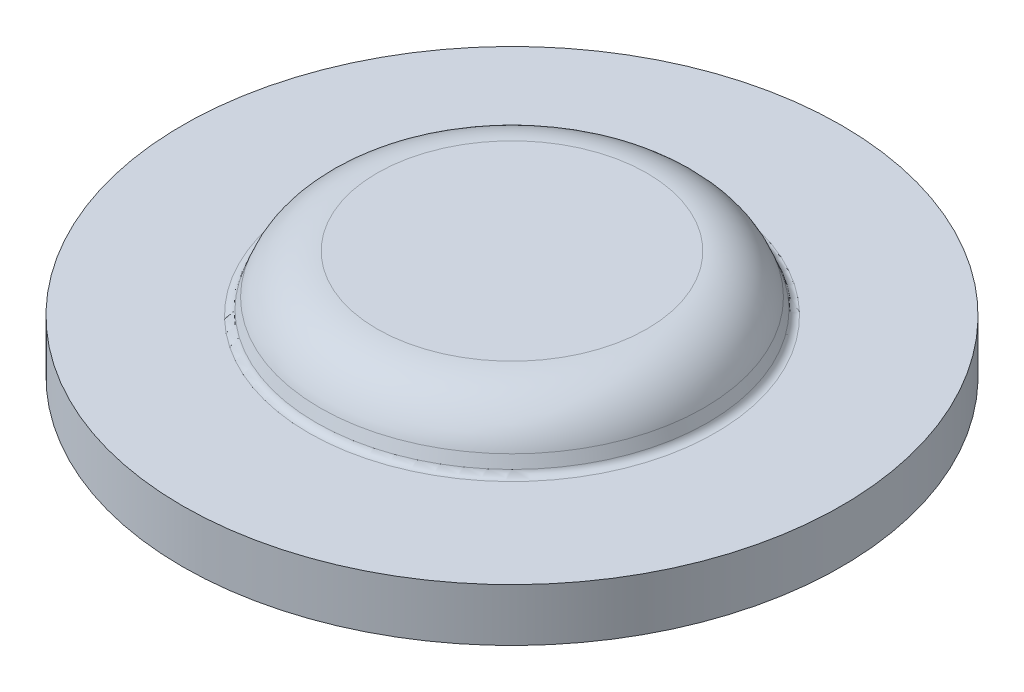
ISO-10303-21;
HEADER;
FILE_DESCRIPTION(('STEP AP214'),'2;1');
FILE_NAME('part.step','',(''),(''),'','','');
FILE_SCHEMA(('AUTOMOTIVE_DESIGN { 1 0 10303 214 1 1 1 1 }'));
ENDSEC;
DATA;
#1=APPLICATION_CONTEXT('core data for automotive mechanical design processes');
#2=APPLICATION_PROTOCOL_DEFINITION('international standard','automotive_design',2000,#1);
#3=PRODUCT_CONTEXT('',#1,'mechanical');
#4=PRODUCT('Part','Part','',(#3));
#5=PRODUCT_RELATED_PRODUCT_CATEGORY('part','',(#4));
#6=PRODUCT_DEFINITION_FORMATION('','',#4);
#7=PRODUCT_DEFINITION_CONTEXT('part definition',#1,'design');
#8=PRODUCT_DEFINITION('design','',#6,#7);
#9=PRODUCT_DEFINITION_SHAPE('','',#8);
#10=(LENGTH_UNIT() NAMED_UNIT(*) SI_UNIT(.MILLI.,.METRE.));
#11=(NAMED_UNIT(*) PLANE_ANGLE_UNIT() SI_UNIT($,.RADIAN.));
#12=(NAMED_UNIT(*) SI_UNIT($,.STERADIAN.) SOLID_ANGLE_UNIT());
#13=UNCERTAINTY_MEASURE_WITH_UNIT(LENGTH_MEASURE(1.E-05),#10,'distance_accuracy_value','');
#14=(GEOMETRIC_REPRESENTATION_CONTEXT(3) GLOBAL_UNCERTAINTY_ASSIGNED_CONTEXT((#13)) GLOBAL_UNIT_ASSIGNED_CONTEXT((#10,
#11,#12)) REPRESENTATION_CONTEXT('',''));
#15=CARTESIAN_POINT('',(0.,0.,0.));
#16=DIRECTION('',(0.,0.,1.));
#17=DIRECTION('',(1.,0.,0.));
#18=AXIS2_PLACEMENT_3D('',#15,#16,#17);
#19=CARTESIAN_POINT('',(0.,0.,0.));
#20=DIRECTION('',(0.,-1.,0.));
#21=DIRECTION('',(0.,0.,-1.));
#22=AXIS2_PLACEMENT_3D('',#19,#20,#21);
#23=PLANE('',#22);
#24=CARTESIAN_POINT('',(0.,0.,0.));
#25=DIRECTION('',(0.,1.,0.));
#26=DIRECTION('',(0.,0.,1.));
#27=AXIS2_PLACEMENT_3D('',#24,#25,#26);
#28=CIRCLE('',#27,6.5024);
#29=CARTESIAN_POINT('',(0.,0.,6.5024));
#30=VERTEX_POINT('',#29);
#31=EDGE_CURVE('E20',#30,#30,#28,.F.);
#32=ORIENTED_EDGE('',*,*,#31,.F.);
#33=EDGE_LOOP('',(#32));
#34=FACE_BOUND('',#33,.T.);
#35=ADVANCED_FACE('F16',(#34),#23,.F.);
#36=CARTESIAN_POINT('',(0.,-2.92099999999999,0.));
#37=DIRECTION('',(0.,1.,0.));
#38=DIRECTION('',(0.,0.,1.));
#39=AXIS2_PLACEMENT_3D('',#36,#37,#38);
#40=TOROIDAL_SURFACE('',#39,6.5024,2.92099999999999);
#41=CARTESIAN_POINT('',(0.,-1.92195916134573,0.));
#42=DIRECTION('',(0.,-1.,0.));
#43=DIRECTION('',(1.,0.,0.));
#44=AXIS2_PLACEMENT_3D('',#41,#42,#43);
#45=CIRCLE('',#44,9.24724214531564);
#46=CARTESIAN_POINT('',(9.24724214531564,-1.92195916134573,0.));
#47=VERTEX_POINT('',#46);
#48=EDGE_CURVE('E32',#47,#47,#45,.T.);
#49=ORIENTED_EDGE('',*,*,#48,.F.);
#50=EDGE_LOOP('',(#49));
#51=FACE_BOUND('',#50,.T.);
#52=ORIENTED_EDGE('',*,*,#31,.T.);
#53=EDGE_LOOP('',(#52));
#54=FACE_BOUND('',#53,.T.);
#55=ADVANCED_FACE('F53',(#51,#54),#40,.T.);
#56=CARTESIAN_POINT('',(0.,-2.54,0.));
#57=DIRECTION('',(0.,1.,0.));
#58=DIRECTION('',(0.,0.,1.));
#59=AXIS2_PLACEMENT_3D('',#56,#57,#58);
#60=PLANE('',#59);
#61=CARTESIAN_POINT('',(0.,-2.54,0.));
#62=DIRECTION('',(0.,1.,0.));
#63=DIRECTION('',(0.,0.,1.));
#64=AXIS2_PLACEMENT_3D('',#61,#62,#63);
#65=CIRCLE('',#64,6.5024);
#66=CARTESIAN_POINT('',(0.,-2.54,6.5024));
#67=VERTEX_POINT('',#66);
#68=EDGE_CURVE('E41',#67,#67,#65,.F.);
#69=ORIENTED_EDGE('',*,*,#68,.T.);
#70=EDGE_LOOP('',(#69));
#71=FACE_BOUND('',#70,.T.);
#72=ADVANCED_FACE('F60',(#71),#60,.F.);
#73=CARTESIAN_POINT('',(0.,-2.44170967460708,0.));
#74=DIRECTION('',(0.,-1.,0.));
#75=DIRECTION('',(1.,0.,0.));
#76=AXIS2_PLACEMENT_3D('',#73,#74,#75);
#77=CONICAL_SURFACE('',#76,9.43641586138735,0.349065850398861);
#78=CARTESIAN_POINT('',(0.,-2.44170967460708,0.));
#79=DIRECTION('',(0.,1.,0.));
#80=DIRECTION('',(0.,0.,-1.));
#81=AXIS2_PLACEMENT_3D('',#78,#79,#80);
#82=CIRCLE('',#81,9.43641586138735);
#83=CARTESIAN_POINT('',(0.,-2.44170967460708,-9.43641586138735));
#84=VERTEX_POINT('',#83);
#85=EDGE_CURVE('E43',#84,#84,#82,.T.);
#86=ORIENTED_EDGE('',*,*,#85,.T.);
#87=EDGE_LOOP('',(#86));
#88=FACE_BOUND('',#87,.T.);
#89=ORIENTED_EDGE('',*,*,#48,.T.);
#90=EDGE_LOOP('',(#89));
#91=FACE_BOUND('',#90,.T.);
#92=ADVANCED_FACE('F85',(#88,#91),#77,.T.);
#93=CARTESIAN_POINT('',(0.,-2.921,0.));
#94=DIRECTION('',(0.,1.,0.));
#95=DIRECTION('',(0.,0.,1.));
#96=AXIS2_PLACEMENT_3D('',#93,#94,#95);
#97=TOROIDAL_SURFACE('',#96,6.5024,0.381000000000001);
#98=ORIENTED_EDGE('',*,*,#68,.F.);
#99=EDGE_LOOP('',(#98));
#100=FACE_BOUND('',#99,.T.);
#101=CARTESIAN_POINT('',(0.,-2.79069032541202,0.));
#102=DIRECTION('',(0.,-1.,0.));
#103=DIRECTION('',(0.,0.,-1.));
#104=AXIS2_PLACEMENT_3D('',#101,#102,#103);
#105=CIRCLE('',#104,6.86042288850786);
#106=CARTESIAN_POINT('',(0.,-2.79069032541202,-6.86042288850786));
#107=VERTEX_POINT('',#106);
#108=EDGE_CURVE('E40',#107,#107,#105,.T.);
#109=ORIENTED_EDGE('',*,*,#108,.T.);
#110=EDGE_LOOP('',(#109));
#111=FACE_BOUND('',#110,.T.);
#112=ADVANCED_FACE('F87',(#100,#111),#97,.F.);
#113=CARTESIAN_POINT('',(0.,-2.3114,0.));
#114=DIRECTION('',(0.,1.,0.));
#115=DIRECTION('',(0.,0.,1.));
#116=AXIS2_PLACEMENT_3D('',#113,#114,#115);
#117=TOROIDAL_SURFACE('',#116,9.79443874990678,0.380999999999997);
#118=CARTESIAN_POINT('',(0.,-2.6924,0.));
#119=DIRECTION('',(0.,1.,0.));
#120=DIRECTION('',(0.,0.,1.));
#121=AXIS2_PLACEMENT_3D('',#118,#119,#120);
#122=CIRCLE('',#121,9.79443874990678);
#123=CARTESIAN_POINT('',(0.,-2.6924,9.79443874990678));
#124=VERTEX_POINT('',#123);
#125=EDGE_CURVE('E38',#124,#124,#122,.T.);
#126=ORIENTED_EDGE('',*,*,#125,.T.);
#127=EDGE_LOOP('',(#126));
#128=FACE_BOUND('',#127,.T.);
#129=ORIENTED_EDGE('',*,*,#85,.F.);
#130=EDGE_LOOP('',(#129));
#131=FACE_BOUND('',#130,.T.);
#132=ADVANCED_FACE('F83',(#128,#131),#117,.F.);
#133=CARTESIAN_POINT('',(0.,-3.31044083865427,0.));
#134=DIRECTION('',(0.,-1.,0.));
#135=DIRECTION('',(1.,0.,0.));
#136=AXIS2_PLACEMENT_3D('',#133,#134,#135);
#137=CONICAL_SURFACE('',#136,7.04959660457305,0.349065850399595);
#138=CARTESIAN_POINT('',(0.,-3.31044083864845,0.));
#139=DIRECTION('',(0.,1.,0.));
#140=DIRECTION('',(0.,0.,-1.));
#141=AXIS2_PLACEMENT_3D('',#138,#139,#140);
#142=CIRCLE('',#141,7.04959660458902);
#143=CARTESIAN_POINT('',(0.,-3.31044083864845,-7.04959660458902));
#144=VERTEX_POINT('',#143);
#145=EDGE_CURVE('E37',#144,#144,#142,.T.);
#146=ORIENTED_EDGE('',*,*,#145,.F.);
#147=EDGE_LOOP('',(#146));
#148=FACE_BOUND('',#147,.T.);
#149=ORIENTED_EDGE('',*,*,#108,.F.);
#150=EDGE_LOOP('',(#149));
#151=FACE_BOUND('',#150,.T.);
#152=ADVANCED_FACE('F79',(#148,#151),#137,.F.);
#153=CARTESIAN_POINT('',(9.79443874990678,-2.6924,0.));
#154=DIRECTION('',(0.,-1.,0.));
#155=DIRECTION('',(0.,0.,-1.));
#156=AXIS2_PLACEMENT_3D('',#153,#154,#155);
#157=PLANE('',#156);
#158=CARTESIAN_POINT('',(0.,-2.6924,0.));
#159=DIRECTION('',(0.,1.,0.));
#160=DIRECTION('',(0.,0.,1.));
#161=AXIS2_PLACEMENT_3D('',#158,#159,#160);
#162=CIRCLE('',#161,15.875);
#163=CARTESIAN_POINT('',(0.,-2.6924,15.875));
#164=VERTEX_POINT('',#163);
#165=EDGE_CURVE('E29',#164,#164,#162,.F.);
#166=ORIENTED_EDGE('',*,*,#165,.F.);
#167=EDGE_LOOP('',(#166));
#168=FACE_BOUND('',#167,.T.);
#169=ORIENTED_EDGE('',*,*,#125,.F.);
#170=EDGE_LOOP('',(#169));
#171=FACE_BOUND('',#170,.T.);
#172=ADVANCED_FACE('F76',(#168,#171),#157,.F.);
#173=CARTESIAN_POINT('',(0.,-2.3114,0.));
#174=DIRECTION('',(0.,1.,0.));
#175=DIRECTION('',(0.,0.,1.));
#176=AXIS2_PLACEMENT_3D('',#173,#174,#175);
#177=TOROIDAL_SURFACE('',#176,9.79443874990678,2.921);
#178=ORIENTED_EDGE('',*,*,#145,.T.);
#179=EDGE_LOOP('',(#178));
#180=FACE_BOUND('',#179,.T.);
#181=CARTESIAN_POINT('',(0.,-5.2324,0.));
#182=DIRECTION('',(0.,1.,0.));
#183=DIRECTION('',(0.,0.,1.));
#184=AXIS2_PLACEMENT_3D('',#181,#182,#183);
#185=CIRCLE('',#184,9.79443874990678);
#186=CARTESIAN_POINT('',(0.,-5.2324,9.79443874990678));
#187=VERTEX_POINT('',#186);
#188=EDGE_CURVE('E24',#187,#187,#185,.F.);
#189=ORIENTED_EDGE('',*,*,#188,.T.);
#190=EDGE_LOOP('',(#189));
#191=FACE_BOUND('',#190,.T.);
#192=ADVANCED_FACE('F18',(#180,#191),#177,.T.);
#193=CARTESIAN_POINT('',(0.,-5.2336539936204,0.));
#194=DIRECTION('',(0.,1.,0.));
#195=DIRECTION('',(0.,0.,1.));
#196=AXIS2_PLACEMENT_3D('',#193,#194,#195);
#197=CYLINDRICAL_SURFACE('',#196,15.875);
#198=ORIENTED_EDGE('',*,*,#165,.T.);
#199=EDGE_LOOP('',(#198));
#200=FACE_BOUND('',#199,.T.);
#201=CARTESIAN_POINT('',(0.,-5.2324,0.));
#202=DIRECTION('',(0.,1.,0.));
#203=DIRECTION('',(0.,0.,1.));
#204=AXIS2_PLACEMENT_3D('',#201,#202,#203);
#205=CIRCLE('',#204,15.875);
#206=CARTESIAN_POINT('',(0.,-5.2324,15.875));
#207=VERTEX_POINT('',#206);
#208=EDGE_CURVE('E10',#207,#207,#205,.T.);
#209=ORIENTED_EDGE('',*,*,#208,.T.);
#210=EDGE_LOOP('',(#209));
#211=FACE_BOUND('',#210,.T.);
#212=ADVANCED_FACE('F66',(#200,#211),#197,.T.);
#213=CARTESIAN_POINT('',(9.79443874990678,-5.2324,0.));
#214=DIRECTION('',(0.,1.,0.));
#215=DIRECTION('',(0.,0.,1.));
#216=AXIS2_PLACEMENT_3D('',#213,#214,#215);
#217=PLANE('',#216);
#218=ORIENTED_EDGE('',*,*,#208,.F.);
#219=EDGE_LOOP('',(#218));
#220=FACE_BOUND('',#219,.T.);
#221=ORIENTED_EDGE('',*,*,#188,.F.);
#222=EDGE_LOOP('',(#221));
#223=FACE_BOUND('',#222,.T.);
#224=ADVANCED_FACE('F64',(#220,#223),#217,.F.);
#225=CLOSED_SHELL('',(#35,#55,#72,#92,#112,#132,#152,#172,#192,#212,#224));
#226=MANIFOLD_SOLID_BREP('B1',#225);
#227=ADVANCED_BREP_SHAPE_REPRESENTATION('',(#18,#226),#14);
#228=SHAPE_DEFINITION_REPRESENTATION(#9,#227);
ENDSEC;
END-ISO-10303-21;
